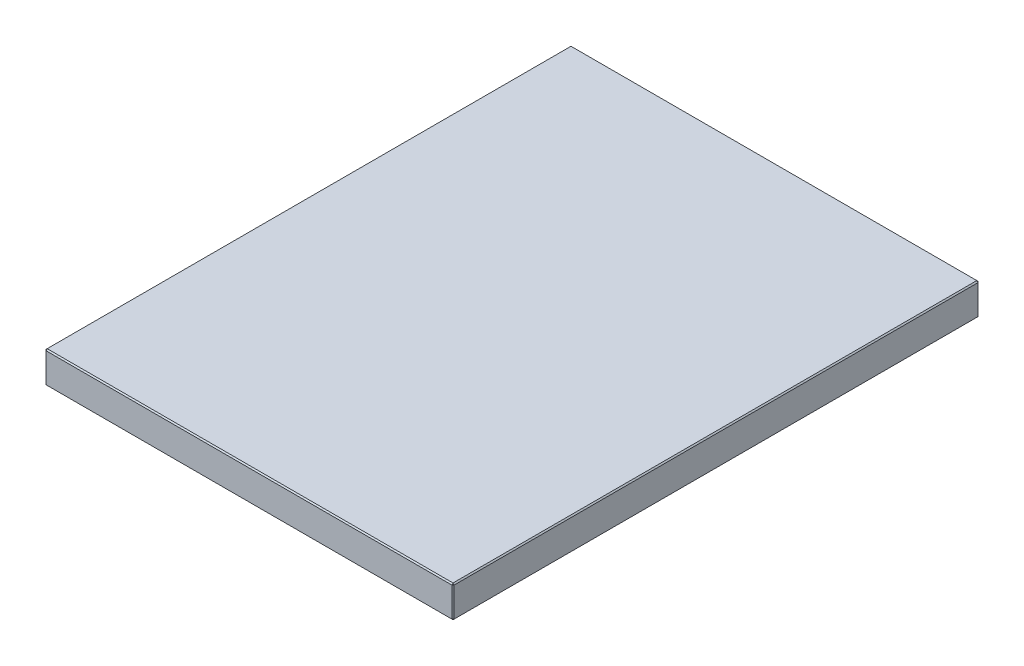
ISO-10303-21;
HEADER;
FILE_DESCRIPTION(('STEP AP214'),'2;1');
FILE_NAME('part.step','',(''),(''),'','','');
FILE_SCHEMA(('AUTOMOTIVE_DESIGN { 1 0 10303 214 1 1 1 1 }'));
ENDSEC;
DATA;
#1=APPLICATION_CONTEXT('core data for automotive mechanical design processes');
#2=APPLICATION_PROTOCOL_DEFINITION('international standard','automotive_design',2000,#1);
#3=PRODUCT_CONTEXT('',#1,'mechanical');
#4=PRODUCT('Part','Part','',(#3));
#5=PRODUCT_RELATED_PRODUCT_CATEGORY('part','',(#4));
#6=PRODUCT_DEFINITION_FORMATION('','',#4);
#7=PRODUCT_DEFINITION_CONTEXT('part definition',#1,'design');
#8=PRODUCT_DEFINITION('design','',#6,#7);
#9=PRODUCT_DEFINITION_SHAPE('','',#8);
#10=(LENGTH_UNIT() NAMED_UNIT(*) SI_UNIT(.MILLI.,.METRE.));
#11=(NAMED_UNIT(*) PLANE_ANGLE_UNIT() SI_UNIT($,.RADIAN.));
#12=(NAMED_UNIT(*) SI_UNIT($,.STERADIAN.) SOLID_ANGLE_UNIT());
#13=UNCERTAINTY_MEASURE_WITH_UNIT(LENGTH_MEASURE(1.E-05),#10,'distance_accuracy_value','');
#14=(GEOMETRIC_REPRESENTATION_CONTEXT(3) GLOBAL_UNCERTAINTY_ASSIGNED_CONTEXT((#13)) GLOBAL_UNIT_ASSIGNED_CONTEXT((#10,
#11,#12)) REPRESENTATION_CONTEXT('',''));
#15=CARTESIAN_POINT('',(0.,0.,0.));
#16=DIRECTION('',(0.,0.,1.));
#17=DIRECTION('',(1.,0.,0.));
#18=AXIS2_PLACEMENT_3D('',#15,#16,#17);
#19=CARTESIAN_POINT('',(173.,27.,223.));
#20=DIRECTION('',(-1.,0.,0.));
#21=DIRECTION('',(0.,0.,1.));
#22=AXIS2_PLACEMENT_3D('',#19,#20,#21);
#23=PLANE('',#22);
#24=DIRECTION('',(0.,0.,-1.));
#25=VECTOR('',#24,1.);
#26=CARTESIAN_POINT('',(173.,0.99999999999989,-223.));
#27=LINE('',#26,#25);
#28=CARTESIAN_POINT('',(173.,0.99999999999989,222.));
#29=VERTEX_POINT('',#28);
#30=CARTESIAN_POINT('',(173.,0.99999999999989,-222.));
#31=VERTEX_POINT('',#30);
#32=EDGE_CURVE('E151',#29,#31,#27,.T.);
#33=ORIENTED_EDGE('',*,*,#32,.T.);
#34=DIRECTION('',(0.,1.,0.));
#35=VECTOR('',#34,1.);
#36=CARTESIAN_POINT('',(173.,27.,-222.));
#37=LINE('',#36,#35);
#38=CARTESIAN_POINT('',(173.,26.,-222.));
#39=VERTEX_POINT('',#38);
#40=EDGE_CURVE('E153',#31,#39,#37,.T.);
#41=ORIENTED_EDGE('',*,*,#40,.T.);
#42=DIRECTION('',(0.,0.,1.));
#43=VECTOR('',#42,1.);
#44=CARTESIAN_POINT('',(173.,26.,223.));
#45=LINE('',#44,#43);
#46=CARTESIAN_POINT('',(173.,26.,222.));
#47=VERTEX_POINT('',#46);
#48=EDGE_CURVE('E147',#39,#47,#45,.T.);
#49=ORIENTED_EDGE('',*,*,#48,.T.);
#50=DIRECTION('',(0.,-1.,0.));
#51=VECTOR('',#50,1.);
#52=CARTESIAN_POINT('',(173.,27.,222.));
#53=LINE('',#52,#51);
#54=EDGE_CURVE('E149',#47,#29,#53,.T.);
#55=ORIENTED_EDGE('',*,*,#54,.T.);
#56=EDGE_LOOP('',(#33,#41,#49,#55));
#57=FACE_BOUND('',#56,.T.);
#58=ADVANCED_FACE('F16',(#57),#23,.F.);
#59=CARTESIAN_POINT('',(-173.,27.,-223.));
#60=DIRECTION('',(0.,0.,1.));
#61=DIRECTION('',(1.,0.,0.));
#62=AXIS2_PLACEMENT_3D('',#59,#60,#61);
#63=PLANE('',#62);
#64=DIRECTION('',(0.,-1.,0.));
#65=VECTOR('',#64,1.);
#66=CARTESIAN_POINT('',(172.,27.,-223.));
#67=LINE('',#66,#65);
#68=CARTESIAN_POINT('',(172.,26.,-223.));
#69=VERTEX_POINT('',#68);
#70=CARTESIAN_POINT('',(172.,0.999999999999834,-223.));
#71=VERTEX_POINT('',#70);
#72=EDGE_CURVE('E115',#69,#71,#67,.T.);
#73=ORIENTED_EDGE('',*,*,#72,.T.);
#74=DIRECTION('',(-1.,0.,0.));
#75=VECTOR('',#74,1.);
#76=CARTESIAN_POINT('',(-173.,0.999999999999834,-223.));
#77=LINE('',#76,#75);
#78=CARTESIAN_POINT('',(-172.,0.999999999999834,-223.));
#79=VERTEX_POINT('',#78);
#80=EDGE_CURVE('E111',#71,#79,#77,.T.);
#81=ORIENTED_EDGE('',*,*,#80,.T.);
#82=DIRECTION('',(0.,1.,0.));
#83=VECTOR('',#82,1.);
#84=CARTESIAN_POINT('',(-172.,27.,-223.));
#85=LINE('',#84,#83);
#86=CARTESIAN_POINT('',(-172.,26.,-223.));
#87=VERTEX_POINT('',#86);
#88=EDGE_CURVE('E103',#79,#87,#85,.T.);
#89=ORIENTED_EDGE('',*,*,#88,.T.);
#90=DIRECTION('',(1.,0.,0.));
#91=VECTOR('',#90,1.);
#92=CARTESIAN_POINT('',(-173.,26.,-223.));
#93=LINE('',#92,#91);
#94=EDGE_CURVE('E108',#87,#69,#93,.T.);
#95=ORIENTED_EDGE('',*,*,#94,.T.);
#96=EDGE_LOOP('',(#73,#81,#89,#95));
#97=FACE_BOUND('',#96,.T.);
#98=ADVANCED_FACE('F106',(#97),#63,.F.);
#99=CARTESIAN_POINT('',(-173.,27.,223.));
#100=DIRECTION('',(1.,0.,0.));
#101=DIRECTION('',(0.,0.,-1.));
#102=AXIS2_PLACEMENT_3D('',#99,#100,#101);
#103=PLANE('',#102);
#104=DIRECTION('',(0.,-1.,0.));
#105=VECTOR('',#104,1.);
#106=CARTESIAN_POINT('',(-173.,27.,-222.));
#107=LINE('',#106,#105);
#108=CARTESIAN_POINT('',(-173.,26.,-222.));
#109=VERTEX_POINT('',#108);
#110=CARTESIAN_POINT('',(-173.,0.999999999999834,-222.));
#111=VERTEX_POINT('',#110);
#112=EDGE_CURVE('E123',#109,#111,#107,.T.);
#113=ORIENTED_EDGE('',*,*,#112,.T.);
#114=DIRECTION('',(0.,0.,1.));
#115=VECTOR('',#114,1.);
#116=CARTESIAN_POINT('',(-173.,0.999999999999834,223.));
#117=LINE('',#116,#115);
#118=CARTESIAN_POINT('',(-173.,0.999999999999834,222.));
#119=VERTEX_POINT('',#118);
#120=EDGE_CURVE('E161',#111,#119,#117,.T.);
#121=ORIENTED_EDGE('',*,*,#120,.T.);
#122=DIRECTION('',(0.,1.,0.));
#123=VECTOR('',#122,1.);
#124=CARTESIAN_POINT('',(-173.,27.,222.));
#125=LINE('',#124,#123);
#126=CARTESIAN_POINT('',(-173.,26.,222.));
#127=VERTEX_POINT('',#126);
#128=EDGE_CURVE('E158',#119,#127,#125,.T.);
#129=ORIENTED_EDGE('',*,*,#128,.T.);
#130=DIRECTION('',(0.,0.,-1.));
#131=VECTOR('',#130,1.);
#132=CARTESIAN_POINT('',(-173.,26.,223.));
#133=LINE('',#132,#131);
#134=EDGE_CURVE('E156',#127,#109,#133,.T.);
#135=ORIENTED_EDGE('',*,*,#134,.T.);
#136=EDGE_LOOP('',(#113,#121,#129,#135));
#137=FACE_BOUND('',#136,.T.);
#138=ADVANCED_FACE('F310',(#137),#103,.F.);
#139=CARTESIAN_POINT('',(-173.,27.,223.));
#140=DIRECTION('',(0.,0.,-1.));
#141=DIRECTION('',(-1.,0.,0.));
#142=AXIS2_PLACEMENT_3D('',#139,#140,#141);
#143=PLANE('',#142);
#144=DIRECTION('',(-1.,0.,0.));
#145=VECTOR('',#144,1.);
#146=CARTESIAN_POINT('',(-173.,26.,223.));
#147=LINE('',#146,#145);
#148=CARTESIAN_POINT('',(172.,26.,223.));
#149=VERTEX_POINT('',#148);
#150=CARTESIAN_POINT('',(-172.,26.,223.));
#151=VERTEX_POINT('',#150);
#152=EDGE_CURVE('E163',#149,#151,#147,.T.);
#153=ORIENTED_EDGE('',*,*,#152,.T.);
#154=DIRECTION('',(0.,-1.,0.));
#155=VECTOR('',#154,1.);
#156=CARTESIAN_POINT('',(-172.,27.,223.));
#157=LINE('',#156,#155);
#158=CARTESIAN_POINT('',(-172.,0.999999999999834,223.));
#159=VERTEX_POINT('',#158);
#160=EDGE_CURVE('E169',#151,#159,#157,.T.);
#161=ORIENTED_EDGE('',*,*,#160,.T.);
#162=DIRECTION('',(1.,0.,0.));
#163=VECTOR('',#162,1.);
#164=CARTESIAN_POINT('',(173.,0.999999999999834,223.));
#165=LINE('',#164,#163);
#166=CARTESIAN_POINT('',(172.,0.999999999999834,223.));
#167=VERTEX_POINT('',#166);
#168=EDGE_CURVE('E167',#159,#167,#165,.T.);
#169=ORIENTED_EDGE('',*,*,#168,.T.);
#170=DIRECTION('',(0.,1.,0.));
#171=VECTOR('',#170,1.);
#172=CARTESIAN_POINT('',(172.,27.,223.));
#173=LINE('',#172,#171);
#174=EDGE_CURVE('E165',#167,#149,#173,.T.);
#175=ORIENTED_EDGE('',*,*,#174,.T.);
#176=EDGE_LOOP('',(#153,#161,#169,#175));
#177=FACE_BOUND('',#176,.T.);
#178=ADVANCED_FACE('F256',(#177),#143,.F.);
#179=CARTESIAN_POINT('',(0.,27.,0.));
#180=DIRECTION('',(0.,-1.,0.));
#181=DIRECTION('',(0.,0.,-1.));
#182=AXIS2_PLACEMENT_3D('',#179,#180,#181);
#183=PLANE('',#182);
#184=DIRECTION('',(0.,0.,1.));
#185=VECTOR('',#184,1.);
#186=CARTESIAN_POINT('',(-172.,27.,0.));
#187=LINE('',#186,#185);
#188=CARTESIAN_POINT('',(-172.,27.,-222.));
#189=VERTEX_POINT('',#188);
#190=CARTESIAN_POINT('',(-172.,27.,222.));
#191=VERTEX_POINT('',#190);
#192=EDGE_CURVE('E25',#189,#191,#187,.T.);
#193=ORIENTED_EDGE('',*,*,#192,.T.);
#194=DIRECTION('',(1.,0.,0.));
#195=VECTOR('',#194,1.);
#196=CARTESIAN_POINT('',(0.,27.,222.));
#197=LINE('',#196,#195);
#198=CARTESIAN_POINT('',(172.,27.,222.));
#199=VERTEX_POINT('',#198);
#200=EDGE_CURVE('E10',#191,#199,#197,.T.);
#201=ORIENTED_EDGE('',*,*,#200,.T.);
#202=DIRECTION('',(0.,0.,-1.));
#203=VECTOR('',#202,1.);
#204=CARTESIAN_POINT('',(172.,27.,0.));
#205=LINE('',#204,#203);
#206=CARTESIAN_POINT('',(172.,27.,-222.));
#207=VERTEX_POINT('',#206);
#208=EDGE_CURVE('E181',#199,#207,#205,.T.);
#209=ORIENTED_EDGE('',*,*,#208,.T.);
#210=DIRECTION('',(-1.,0.,0.));
#211=VECTOR('',#210,1.);
#212=CARTESIAN_POINT('',(0.,27.,-222.));
#213=LINE('',#212,#211);
#214=EDGE_CURVE('E36',#207,#189,#213,.T.);
#215=ORIENTED_EDGE('',*,*,#214,.T.);
#216=EDGE_LOOP('',(#193,#201,#209,#215));
#217=FACE_BOUND('',#216,.T.);
#218=ADVANCED_FACE('F271',(#217),#183,.F.);
#219=CARTESIAN_POINT('',(0.,0.,0.));
#220=DIRECTION('',(0.,-1.,0.));
#221=DIRECTION('',(0.,0.,-1.));
#222=AXIS2_PLACEMENT_3D('',#219,#220,#221);
#223=PLANE('',#222);
#224=DIRECTION('',(0.,0.,-1.));
#225=VECTOR('',#224,1.);
#226=CARTESIAN_POINT('',(-172.,0.,-223.));
#227=LINE('',#226,#225);
#228=CARTESIAN_POINT('',(-172.,0.,222.));
#229=VERTEX_POINT('',#228);
#230=CARTESIAN_POINT('',(-172.,0.,-222.));
#231=VERTEX_POINT('',#230);
#232=EDGE_CURVE('E176',#229,#231,#227,.T.);
#233=ORIENTED_EDGE('',*,*,#232,.T.);
#234=DIRECTION('',(1.,0.,0.));
#235=VECTOR('',#234,1.);
#236=CARTESIAN_POINT('',(173.,0.,-222.));
#237=LINE('',#236,#235);
#238=CARTESIAN_POINT('',(172.,0.,-222.));
#239=VERTEX_POINT('',#238);
#240=EDGE_CURVE('E178',#231,#239,#237,.T.);
#241=ORIENTED_EDGE('',*,*,#240,.T.);
#242=DIRECTION('',(0.,0.,1.));
#243=VECTOR('',#242,1.);
#244=CARTESIAN_POINT('',(172.,0.,223.));
#245=LINE('',#244,#243);
#246=CARTESIAN_POINT('',(172.,0.,222.));
#247=VERTEX_POINT('',#246);
#248=EDGE_CURVE('E172',#239,#247,#245,.T.);
#249=ORIENTED_EDGE('',*,*,#248,.T.);
#250=DIRECTION('',(-1.,0.,0.));
#251=VECTOR('',#250,1.);
#252=CARTESIAN_POINT('',(-173.,0.,222.));
#253=LINE('',#252,#251);
#254=EDGE_CURVE('E174',#247,#229,#253,.T.);
#255=ORIENTED_EDGE('',*,*,#254,.T.);
#256=EDGE_LOOP('',(#233,#241,#249,#255));
#257=FACE_BOUND('',#256,.T.);
#258=ADVANCED_FACE('F247',(#257),#223,.T.);
#259=CARTESIAN_POINT('',(-172.,27.,223.));
#260=DIRECTION('',(0.707106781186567,0.,-0.707106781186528));
#261=DIRECTION('',(0.,-1.,0.));
#262=AXIS2_PLACEMENT_3D('',#259,#260,#261);
#263=PLANE('',#262);
#264=DIRECTION('',(-0.707106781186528,0.,-0.707106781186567));
#265=VECTOR('',#264,1.);
#266=CARTESIAN_POINT('',(-173.,26.,222.));
#267=LINE('',#266,#265);
#268=EDGE_CURVE('E20',#127,#151,#267,.F.);
#269=ORIENTED_EDGE('',*,*,#268,.F.);
#270=ORIENTED_EDGE('',*,*,#128,.F.);
#271=DIRECTION('',(0.707106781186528,0.,0.707106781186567));
#272=VECTOR('',#271,1.);
#273=CARTESIAN_POINT('',(-172.,0.999999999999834,223.));
#274=LINE('',#273,#272);
#275=EDGE_CURVE('E143',#159,#119,#274,.F.);
#276=ORIENTED_EDGE('',*,*,#275,.F.);
#277=ORIENTED_EDGE('',*,*,#160,.F.);
#278=EDGE_LOOP('',(#269,#270,#276,#277));
#279=FACE_BOUND('',#278,.T.);
#280=ADVANCED_FACE('F18',(#279),#263,.F.);
#281=CARTESIAN_POINT('',(-173.,26.,222.));
#282=DIRECTION('',(-0.577350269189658,0.577350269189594,0.577350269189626));
#283=DIRECTION('',(0.707106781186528,0.,0.707106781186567));
#284=AXIS2_PLACEMENT_3D('',#281,#282,#283);
#285=PLANE('',#284);
#286=DIRECTION('',(0.707106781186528,0.707106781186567,0.));
#287=VECTOR('',#286,1.);
#288=CARTESIAN_POINT('',(-173.,26.,222.));
#289=LINE('',#288,#287);
#290=EDGE_CURVE('E227',#127,#191,#289,.T.);
#291=ORIENTED_EDGE('',*,*,#290,.F.);
#292=ORIENTED_EDGE('',*,*,#268,.T.);
#293=DIRECTION('',(0.,-0.707106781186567,0.707106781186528));
#294=VECTOR('',#293,1.);
#295=CARTESIAN_POINT('',(-172.,26.5,222.5));
#296=LINE('',#295,#294);
#297=EDGE_CURVE('E229',#191,#151,#296,.T.);
#298=ORIENTED_EDGE('',*,*,#297,.F.);
#299=EDGE_LOOP('',(#291,#292,#298));
#300=FACE_BOUND('',#299,.T.);
#301=ADVANCED_FACE('F460',(#300),#285,.T.);
#302=CARTESIAN_POINT('',(-172.,0.999999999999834,223.));
#303=DIRECTION('',(-0.577350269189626,-0.577350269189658,0.577350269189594));
#304=DIRECTION('',(0.707106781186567,-0.707106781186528,0.));
#305=AXIS2_PLACEMENT_3D('',#302,#303,#304);
#306=PLANE('',#305);
#307=DIRECTION('',(0.,0.707106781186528,0.707106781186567));
#308=VECTOR('',#307,1.);
#309=CARTESIAN_POINT('',(-172.,0.999999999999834,223.));
#310=LINE('',#309,#308);
#311=EDGE_CURVE('E221',#159,#229,#310,.F.);
#312=ORIENTED_EDGE('',*,*,#311,.F.);
#313=ORIENTED_EDGE('',*,*,#275,.T.);
#314=DIRECTION('',(0.707106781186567,-0.707106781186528,0.));
#315=VECTOR('',#314,1.);
#316=CARTESIAN_POINT('',(-172.5,0.499999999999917,222.));
#317=LINE('',#316,#315);
#318=EDGE_CURVE('E224',#229,#119,#317,.F.);
#319=ORIENTED_EDGE('',*,*,#318,.F.);
#320=EDGE_LOOP('',(#312,#313,#319));
#321=FACE_BOUND('',#320,.T.);
#322=ADVANCED_FACE('F236',(#321),#306,.T.);
#323=CARTESIAN_POINT('',(0.,27.,222.));
#324=DIRECTION('',(0.,-0.707106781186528,-0.707106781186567));
#325=DIRECTION('',(1.,0.,0.));
#326=AXIS2_PLACEMENT_3D('',#323,#324,#325);
#327=PLANE('',#326);
#328=ORIENTED_EDGE('',*,*,#297,.T.);
#329=ORIENTED_EDGE('',*,*,#152,.F.);
#330=DIRECTION('',(0.,0.707106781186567,-0.707106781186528));
#331=VECTOR('',#330,1.);
#332=CARTESIAN_POINT('',(172.,26.,223.));
#333=LINE('',#332,#331);
#334=EDGE_CURVE('E215',#199,#149,#333,.F.);
#335=ORIENTED_EDGE('',*,*,#334,.F.);
#336=ORIENTED_EDGE('',*,*,#200,.F.);
#337=EDGE_LOOP('',(#328,#329,#335,#336));
#338=FACE_BOUND('',#337,.T.);
#339=ADVANCED_FACE('F270',(#338),#327,.F.);
#340=CARTESIAN_POINT('',(-172.,27.,0.));
#341=DIRECTION('',(0.707106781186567,-0.707106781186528,0.));
#342=DIRECTION('',(0.,0.,1.));
#343=AXIS2_PLACEMENT_3D('',#340,#341,#342);
#344=PLANE('',#343);
#345=ORIENTED_EDGE('',*,*,#290,.T.);
#346=ORIENTED_EDGE('',*,*,#192,.F.);
#347=DIRECTION('',(-0.707106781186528,-0.707106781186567,0.));
#348=VECTOR('',#347,1.);
#349=CARTESIAN_POINT('',(-172.5,26.5,-222.));
#350=LINE('',#349,#348);
#351=EDGE_CURVE('E127',#109,#189,#350,.F.);
#352=ORIENTED_EDGE('',*,*,#351,.F.);
#353=ORIENTED_EDGE('',*,*,#134,.F.);
#354=EDGE_LOOP('',(#345,#346,#352,#353));
#355=FACE_BOUND('',#354,.T.);
#356=ADVANCED_FACE('F437',(#355),#344,.F.);
#357=CARTESIAN_POINT('',(-173.,27.,-222.));
#358=DIRECTION('',(0.707106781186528,0.,0.707106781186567));
#359=DIRECTION('',(0.,-1.,0.));
#360=AXIS2_PLACEMENT_3D('',#357,#358,#359);
#361=PLANE('',#360);
#362=DIRECTION('',(-0.707106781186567,0.,0.707106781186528));
#363=VECTOR('',#362,1.);
#364=CARTESIAN_POINT('',(-173.,0.999999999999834,-222.));
#365=LINE('',#364,#363);
#366=EDGE_CURVE('E128',#111,#79,#365,.F.);
#367=ORIENTED_EDGE('',*,*,#366,.F.);
#368=ORIENTED_EDGE('',*,*,#112,.F.);
#369=DIRECTION('',(0.707106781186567,0.,-0.707106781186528));
#370=VECTOR('',#369,1.);
#371=CARTESIAN_POINT('',(-172.,26.,-223.));
#372=LINE('',#371,#370);
#373=EDGE_CURVE('E119',#87,#109,#372,.F.);
#374=ORIENTED_EDGE('',*,*,#373,.F.);
#375=ORIENTED_EDGE('',*,*,#88,.F.);
#376=EDGE_LOOP('',(#367,#368,#374,#375));
#377=FACE_BOUND('',#376,.T.);
#378=ADVANCED_FACE('F121',(#377),#361,.F.);
#379=CARTESIAN_POINT('',(-173.,0.999999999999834,223.));
#380=DIRECTION('',(-0.707106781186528,-0.707106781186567,0.));
#381=DIRECTION('',(0.,0.,-1.));
#382=AXIS2_PLACEMENT_3D('',#379,#380,#381);
#383=PLANE('',#382);
#384=ORIENTED_EDGE('',*,*,#318,.T.);
#385=ORIENTED_EDGE('',*,*,#120,.F.);
#386=DIRECTION('',(-0.707106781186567,0.707106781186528,0.));
#387=VECTOR('',#386,1.);
#388=CARTESIAN_POINT('',(-173.,0.999999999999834,-222.));
#389=LINE('',#388,#387);
#390=EDGE_CURVE('E211',#231,#111,#389,.T.);
#391=ORIENTED_EDGE('',*,*,#390,.F.);
#392=ORIENTED_EDGE('',*,*,#232,.F.);
#393=EDGE_LOOP('',(#384,#385,#391,#392));
#394=FACE_BOUND('',#393,.T.);
#395=ADVANCED_FACE('F243',(#394),#383,.T.);
#396=CARTESIAN_POINT('',(-173.,0.999999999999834,223.));
#397=DIRECTION('',(0.,-0.707106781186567,0.707106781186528));
#398=DIRECTION('',(-1.,0.,0.));
#399=AXIS2_PLACEMENT_3D('',#396,#397,#398);
#400=PLANE('',#399);
#401=ORIENTED_EDGE('',*,*,#311,.T.);
#402=ORIENTED_EDGE('',*,*,#254,.F.);
#403=DIRECTION('',(0.,-0.707106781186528,-0.707106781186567));
#404=VECTOR('',#403,1.);
#405=CARTESIAN_POINT('',(172.,0.999999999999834,223.));
#406=LINE('',#405,#404);
#407=EDGE_CURVE('E208',#167,#247,#406,.T.);
#408=ORIENTED_EDGE('',*,*,#407,.F.);
#409=ORIENTED_EDGE('',*,*,#168,.F.);
#410=EDGE_LOOP('',(#401,#402,#408,#409));
#411=FACE_BOUND('',#410,.T.);
#412=ADVANCED_FACE('F253',(#411),#400,.T.);
#413=CARTESIAN_POINT('',(173.,27.,222.));
#414=DIRECTION('',(-0.707106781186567,0.,-0.707106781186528));
#415=DIRECTION('',(0.,-1.,0.));
#416=AXIS2_PLACEMENT_3D('',#413,#414,#415);
#417=PLANE('',#416);
#418=DIRECTION('',(-0.707106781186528,0.,0.707106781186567));
#419=VECTOR('',#418,1.);
#420=CARTESIAN_POINT('',(172.,26.,223.));
#421=LINE('',#420,#419);
#422=EDGE_CURVE('E218',#149,#47,#421,.F.);
#423=ORIENTED_EDGE('',*,*,#422,.F.);
#424=ORIENTED_EDGE('',*,*,#174,.F.);
#425=DIRECTION('',(0.707106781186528,0.,-0.707106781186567));
#426=VECTOR('',#425,1.);
#427=CARTESIAN_POINT('',(172.,0.999999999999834,223.));
#428=LINE('',#427,#426);
#429=EDGE_CURVE('E205',#29,#167,#428,.F.);
#430=ORIENTED_EDGE('',*,*,#429,.F.);
#431=ORIENTED_EDGE('',*,*,#54,.F.);
#432=EDGE_LOOP('',(#423,#424,#430,#431));
#433=FACE_BOUND('',#432,.T.);
#434=ADVANCED_FACE('F261',(#433),#417,.F.);
#435=CARTESIAN_POINT('',(172.,26.,223.));
#436=DIRECTION('',(0.577350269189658,0.577350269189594,0.577350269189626));
#437=DIRECTION('',(0.707106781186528,0.,-0.707106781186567));
#438=AXIS2_PLACEMENT_3D('',#435,#436,#437);
#439=PLANE('',#438);
#440=ORIENTED_EDGE('',*,*,#334,.T.);
#441=ORIENTED_EDGE('',*,*,#422,.T.);
#442=DIRECTION('',(0.707106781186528,-0.707106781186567,0.));
#443=VECTOR('',#442,1.);
#444=CARTESIAN_POINT('',(172.5,26.5,222.));
#445=LINE('',#444,#443);
#446=EDGE_CURVE('E134',#199,#47,#445,.T.);
#447=ORIENTED_EDGE('',*,*,#446,.F.);
#448=EDGE_LOOP('',(#440,#441,#447));
#449=FACE_BOUND('',#448,.T.);
#450=ADVANCED_FACE('F267',(#449),#439,.T.);
#451=CARTESIAN_POINT('',(-172.,26.,-223.));
#452=DIRECTION('',(-0.577350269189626,0.577350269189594,-0.577350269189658));
#453=DIRECTION('',(-0.707106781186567,0.,0.707106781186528));
#454=AXIS2_PLACEMENT_3D('',#451,#452,#453);
#455=PLANE('',#454);
#456=ORIENTED_EDGE('',*,*,#373,.T.);
#457=ORIENTED_EDGE('',*,*,#351,.T.);
#458=DIRECTION('',(0.,0.707106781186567,0.707106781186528));
#459=VECTOR('',#458,1.);
#460=CARTESIAN_POINT('',(-172.,26.,-223.));
#461=LINE('',#460,#459);
#462=EDGE_CURVE('E131',#87,#189,#461,.T.);
#463=ORIENTED_EDGE('',*,*,#462,.F.);
#464=EDGE_LOOP('',(#456,#457,#463));
#465=FACE_BOUND('',#464,.T.);
#466=ADVANCED_FACE('F132',(#465),#455,.T.);
#467=CARTESIAN_POINT('',(-173.,0.999999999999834,-222.));
#468=DIRECTION('',(-0.577350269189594,-0.577350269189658,-0.577350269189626));
#469=DIRECTION('',(0.,0.707106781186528,-0.707106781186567));
#470=AXIS2_PLACEMENT_3D('',#467,#468,#469);
#471=PLANE('',#470);
#472=ORIENTED_EDGE('',*,*,#390,.T.);
#473=ORIENTED_EDGE('',*,*,#366,.T.);
#474=DIRECTION('',(0.,-0.707106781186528,0.707106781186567));
#475=VECTOR('',#474,1.);
#476=CARTESIAN_POINT('',(-172.,0.499999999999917,-222.5));
#477=LINE('',#476,#475);
#478=EDGE_CURVE('E135',#231,#79,#477,.F.);
#479=ORIENTED_EDGE('',*,*,#478,.F.);
#480=EDGE_LOOP('',(#472,#473,#479));
#481=FACE_BOUND('',#480,.T.);
#482=ADVANCED_FACE('F290',(#481),#471,.T.);
#483=CARTESIAN_POINT('',(172.,0.999999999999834,223.));
#484=DIRECTION('',(0.577350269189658,-0.577350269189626,0.577350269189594));
#485=DIRECTION('',(0.707106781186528,0.707106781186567,0.));
#486=AXIS2_PLACEMENT_3D('',#483,#484,#485);
#487=PLANE('',#486);
#488=ORIENTED_EDGE('',*,*,#429,.T.);
#489=ORIENTED_EDGE('',*,*,#407,.T.);
#490=DIRECTION('',(0.707106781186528,0.707106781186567,0.));
#491=VECTOR('',#490,1.);
#492=CARTESIAN_POINT('',(172.5,0.499999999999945,222.));
#493=LINE('',#492,#491);
#494=EDGE_CURVE('E198',#29,#247,#493,.F.);
#495=ORIENTED_EDGE('',*,*,#494,.F.);
#496=EDGE_LOOP('',(#488,#489,#495));
#497=FACE_BOUND('',#496,.T.);
#498=ADVANCED_FACE('F292',(#497),#487,.T.);
#499=CARTESIAN_POINT('',(172.,27.,0.));
#500=DIRECTION('',(-0.707106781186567,-0.707106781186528,0.));
#501=DIRECTION('',(0.,0.,-1.));
#502=AXIS2_PLACEMENT_3D('',#499,#500,#501);
#503=PLANE('',#502);
#504=ORIENTED_EDGE('',*,*,#446,.T.);
#505=ORIENTED_EDGE('',*,*,#48,.F.);
#506=DIRECTION('',(-0.707106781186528,0.707106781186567,0.));
#507=VECTOR('',#506,1.);
#508=CARTESIAN_POINT('',(173.,26.,-222.));
#509=LINE('',#508,#507);
#510=EDGE_CURVE('E195',#207,#39,#509,.F.);
#511=ORIENTED_EDGE('',*,*,#510,.F.);
#512=ORIENTED_EDGE('',*,*,#208,.F.);
#513=EDGE_LOOP('',(#504,#505,#511,#512));
#514=FACE_BOUND('',#513,.T.);
#515=ADVANCED_FACE('F275',(#514),#503,.F.);
#516=CARTESIAN_POINT('',(0.,27.,-222.));
#517=DIRECTION('',(0.,-0.707106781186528,0.707106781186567));
#518=DIRECTION('',(-1.,0.,0.));
#519=AXIS2_PLACEMENT_3D('',#516,#517,#518);
#520=PLANE('',#519);
#521=ORIENTED_EDGE('',*,*,#462,.T.);
#522=ORIENTED_EDGE('',*,*,#214,.F.);
#523=DIRECTION('',(0.,-0.707106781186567,-0.707106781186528));
#524=VECTOR('',#523,1.);
#525=CARTESIAN_POINT('',(172.,26.5,-222.5));
#526=LINE('',#525,#524);
#527=EDGE_CURVE('E139',#69,#207,#526,.F.);
#528=ORIENTED_EDGE('',*,*,#527,.F.);
#529=ORIENTED_EDGE('',*,*,#94,.F.);
#530=EDGE_LOOP('',(#521,#522,#528,#529));
#531=FACE_BOUND('',#530,.T.);
#532=ADVANCED_FACE('F137',(#531),#520,.F.);
#533=CARTESIAN_POINT('',(-173.,0.999999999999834,-223.));
#534=DIRECTION('',(0.,-0.707106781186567,-0.707106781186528));
#535=DIRECTION('',(1.,0.,0.));
#536=AXIS2_PLACEMENT_3D('',#533,#534,#535);
#537=PLANE('',#536);
#538=ORIENTED_EDGE('',*,*,#478,.T.);
#539=ORIENTED_EDGE('',*,*,#80,.F.);
#540=DIRECTION('',(0.,0.707106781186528,-0.707106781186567));
#541=VECTOR('',#540,1.);
#542=CARTESIAN_POINT('',(172.,0.999999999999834,-223.));
#543=LINE('',#542,#541);
#544=EDGE_CURVE('E191',#239,#71,#543,.T.);
#545=ORIENTED_EDGE('',*,*,#544,.F.);
#546=ORIENTED_EDGE('',*,*,#240,.F.);
#547=EDGE_LOOP('',(#538,#539,#545,#546));
#548=FACE_BOUND('',#547,.T.);
#549=ADVANCED_FACE('F288',(#548),#537,.T.);
#550=CARTESIAN_POINT('',(173.,0.99999999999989,223.));
#551=DIRECTION('',(0.707106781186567,-0.707106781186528,0.));
#552=DIRECTION('',(0.,0.,1.));
#553=AXIS2_PLACEMENT_3D('',#550,#551,#552);
#554=PLANE('',#553);
#555=ORIENTED_EDGE('',*,*,#494,.T.);
#556=ORIENTED_EDGE('',*,*,#248,.F.);
#557=DIRECTION('',(-0.707106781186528,-0.707106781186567,0.));
#558=VECTOR('',#557,1.);
#559=CARTESIAN_POINT('',(172.5,0.499999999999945,-222.));
#560=LINE('',#559,#558);
#561=EDGE_CURVE('E189',#31,#239,#560,.T.);
#562=ORIENTED_EDGE('',*,*,#561,.F.);
#563=ORIENTED_EDGE('',*,*,#32,.F.);
#564=EDGE_LOOP('',(#555,#556,#562,#563));
#565=FACE_BOUND('',#564,.T.);
#566=ADVANCED_FACE('F320',(#565),#554,.T.);
#567=CARTESIAN_POINT('',(173.,26.,-222.));
#568=DIRECTION('',(0.577350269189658,0.577350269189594,-0.577350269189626));
#569=DIRECTION('',(-0.707106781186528,0.,-0.707106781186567));
#570=AXIS2_PLACEMENT_3D('',#567,#568,#569);
#571=PLANE('',#570);
#572=ORIENTED_EDGE('',*,*,#527,.T.);
#573=ORIENTED_EDGE('',*,*,#510,.T.);
#574=DIRECTION('',(0.707106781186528,0.,0.707106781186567));
#575=VECTOR('',#574,1.);
#576=CARTESIAN_POINT('',(173.,26.,-222.));
#577=LINE('',#576,#575);
#578=EDGE_CURVE('E187',#69,#39,#577,.T.);
#579=ORIENTED_EDGE('',*,*,#578,.F.);
#580=EDGE_LOOP('',(#572,#573,#579));
#581=FACE_BOUND('',#580,.T.);
#582=ADVANCED_FACE('F277',(#581),#571,.T.);
#583=CARTESIAN_POINT('',(172.,0.999999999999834,-223.));
#584=DIRECTION('',(0.577350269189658,-0.577350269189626,-0.577350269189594));
#585=DIRECTION('',(0.707106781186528,0.707106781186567,0.));
#586=AXIS2_PLACEMENT_3D('',#583,#584,#585);
#587=PLANE('',#586);
#588=ORIENTED_EDGE('',*,*,#561,.T.);
#589=ORIENTED_EDGE('',*,*,#544,.T.);
#590=DIRECTION('',(-0.707106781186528,0.,-0.707106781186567));
#591=VECTOR('',#590,1.);
#592=CARTESIAN_POINT('',(172.,0.999999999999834,-223.));
#593=LINE('',#592,#591);
#594=EDGE_CURVE('E185',#31,#71,#593,.T.);
#595=ORIENTED_EDGE('',*,*,#594,.F.);
#596=EDGE_LOOP('',(#588,#589,#595));
#597=FACE_BOUND('',#596,.T.);
#598=ADVANCED_FACE('F285',(#597),#587,.T.);
#599=CARTESIAN_POINT('',(172.,27.,-223.));
#600=DIRECTION('',(-0.707106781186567,0.,0.707106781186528));
#601=DIRECTION('',(0.,-1.,0.));
#602=AXIS2_PLACEMENT_3D('',#599,#600,#601);
#603=PLANE('',#602);
#604=ORIENTED_EDGE('',*,*,#578,.T.);
#605=ORIENTED_EDGE('',*,*,#40,.F.);
#606=ORIENTED_EDGE('',*,*,#594,.T.);
#607=ORIENTED_EDGE('',*,*,#72,.F.);
#608=EDGE_LOOP('',(#604,#605,#606,#607));
#609=FACE_BOUND('',#608,.T.);
#610=ADVANCED_FACE('F281',(#609),#603,.F.);
#611=CLOSED_SHELL('',(#58,#98,#138,#178,#218,#258,#280,#301,#322,#339,#356,#378,#395,#412,#434,
#450,#466,#482,#498,#515,#532,#549,#566,#582,#598,#610));
#612=MANIFOLD_SOLID_BREP('B1',#611);
#613=ADVANCED_BREP_SHAPE_REPRESENTATION('',(#18,#612),#14);
#614=SHAPE_DEFINITION_REPRESENTATION(#9,#613);
ENDSEC;
END-ISO-10303-21;
